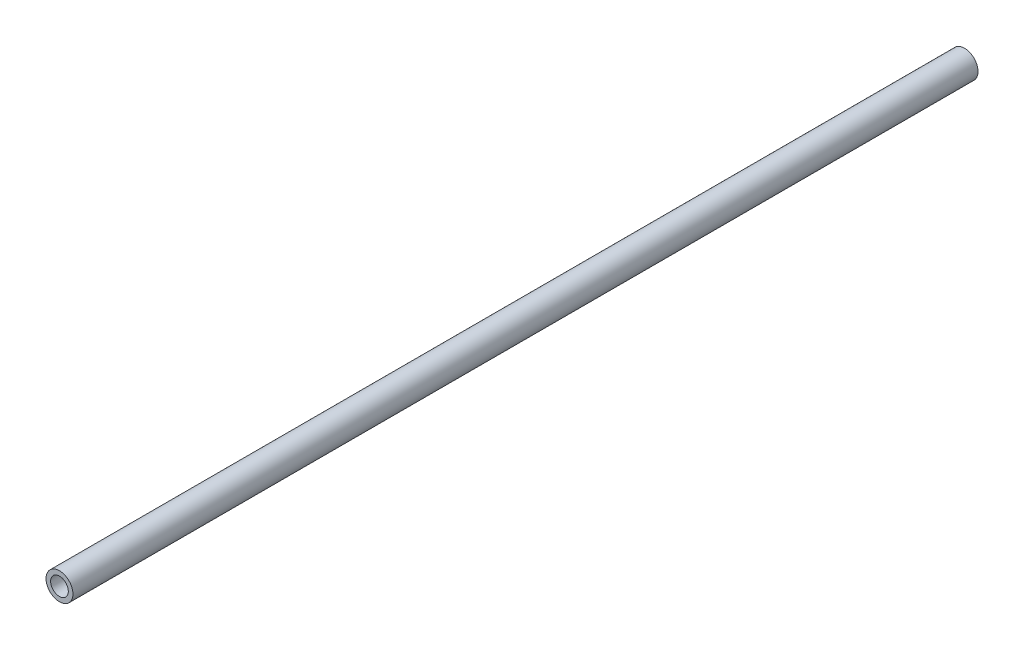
from build123d import *

# Parameters (mm, degrees)
ESQUISSE1_R        = 3.05
ESQUISSE1_R_2      = 2
BOSS_EXTRU_1_DEPTH = 205


with BuildPart() as part:
    # Esquisse1 → Boss.-Extru.1 (new body)
    with BuildSketch(Plane.XY):
        with Locations(Location((0, 0, 0), (0, 0, 180))):
            Circle(ESQUISSE1_R)
        with Locations(Location((0, 0, 0), (0, 0, 180))):
            Circle(ESQUISSE1_R_2, mode=Mode.SUBTRACT)
    extrude(amount=BOSS_EXTRU_1_DEPTH)


solid = part.part
